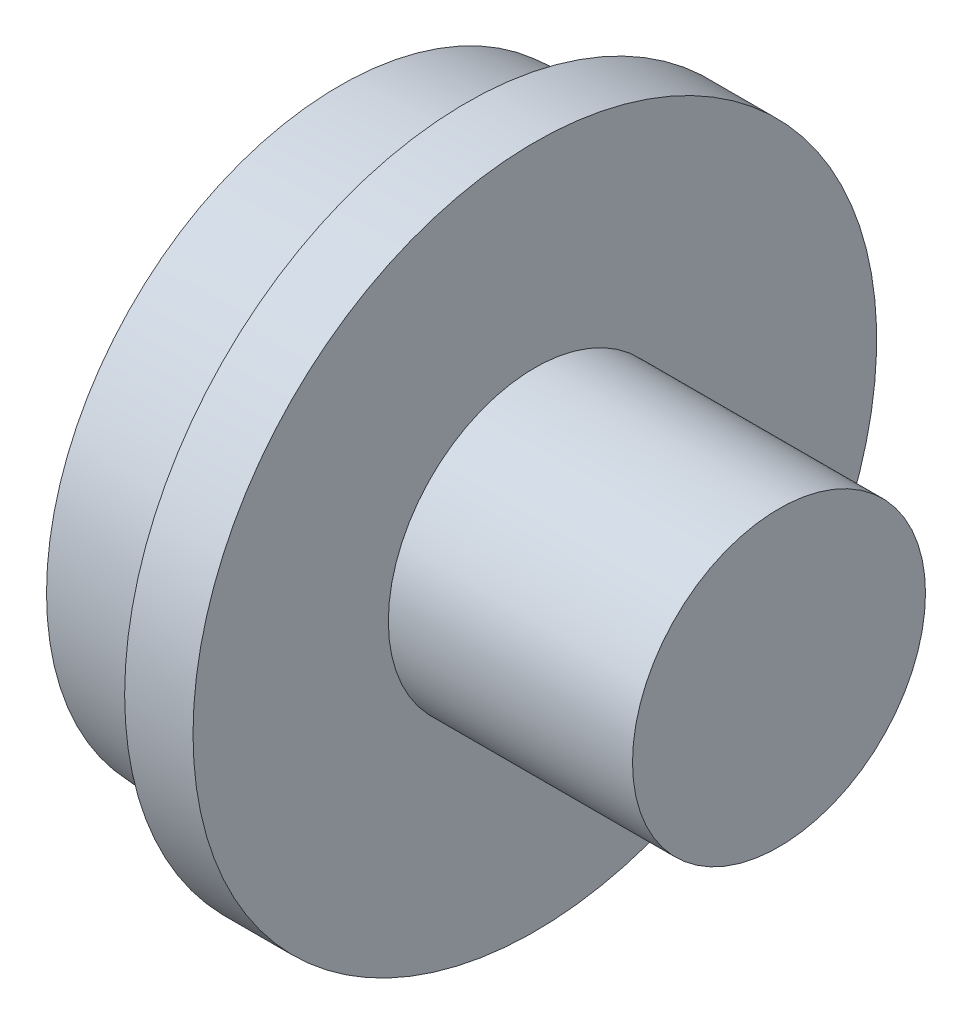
from build123d import *


with BuildPart() as part:
    # Esquisse1 → R_volution1 (revolve)
    with BuildSketch(Plane.XY, mode=Mode.PRIVATE) as r_volution1_sk:
        Polygon((-50, 70), (-50, 30), (0, 30), (0, 0), (-100, 0), (-100, 45), (-90, 45), (-90, 60), (-64, 61.95494982), (-64, 70), align=None)
    revolve(r_volution1_sk.sketch.rotate(Axis((-100, 0, 0), (1, 0, 0)), 90), axis=Axis((-100, 0, 0), (1, 0, 0)))


solid = part.part
